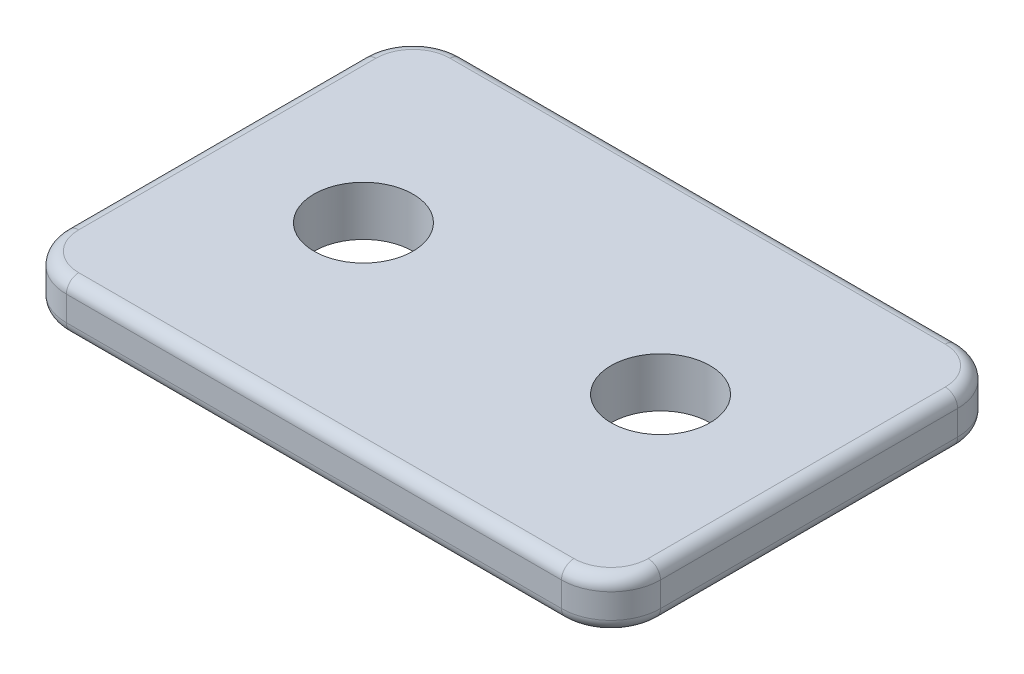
ISO-10303-21;
HEADER;
FILE_DESCRIPTION(('STEP AP214'),'2;1');
FILE_NAME('part.step','',(''),(''),'','','');
FILE_SCHEMA(('AUTOMOTIVE_DESIGN { 1 0 10303 214 1 1 1 1 }'));
ENDSEC;
DATA;
#1=APPLICATION_CONTEXT('core data for automotive mechanical design processes');
#2=APPLICATION_PROTOCOL_DEFINITION('international standard','automotive_design',2000,#1);
#3=PRODUCT_CONTEXT('',#1,'mechanical');
#4=PRODUCT('Part','Part','',(#3));
#5=PRODUCT_RELATED_PRODUCT_CATEGORY('part','',(#4));
#6=PRODUCT_DEFINITION_FORMATION('','',#4);
#7=PRODUCT_DEFINITION_CONTEXT('part definition',#1,'design');
#8=PRODUCT_DEFINITION('design','',#6,#7);
#9=PRODUCT_DEFINITION_SHAPE('','',#8);
#10=(LENGTH_UNIT() NAMED_UNIT(*) SI_UNIT(.MILLI.,.METRE.));
#11=(NAMED_UNIT(*) PLANE_ANGLE_UNIT() SI_UNIT($,.RADIAN.));
#12=(NAMED_UNIT(*) SI_UNIT($,.STERADIAN.) SOLID_ANGLE_UNIT());
#13=UNCERTAINTY_MEASURE_WITH_UNIT(LENGTH_MEASURE(1.E-05),#10,'distance_accuracy_value','');
#14=(GEOMETRIC_REPRESENTATION_CONTEXT(3) GLOBAL_UNCERTAINTY_ASSIGNED_CONTEXT((#13)) GLOBAL_UNIT_ASSIGNED_CONTEXT((#10,
#11,#12)) REPRESENTATION_CONTEXT('',''));
#15=CARTESIAN_POINT('',(0.,0.,0.));
#16=DIRECTION('',(0.,0.,1.));
#17=DIRECTION('',(1.,0.,0.));
#18=AXIS2_PLACEMENT_3D('',#15,#16,#17);
#19=CARTESIAN_POINT('',(0.,0.,50.8));
#20=DIRECTION('',(-1.,0.,0.));
#21=DIRECTION('',(0.,-1.,0.));
#22=AXIS2_PLACEMENT_3D('',#19,#20,#21);
#23=PLANE('',#22);
#24=DIRECTION('',(0.,1.,0.));
#25=VECTOR('',#24,1.);
#26=CARTESIAN_POINT('',(0.,6.34999999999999,44.45));
#27=LINE('',#26,#25);
#28=CARTESIAN_POINT('',(0.,1.5875,44.45));
#29=VERTEX_POINT('',#28);
#30=CARTESIAN_POINT('',(0.,4.76249999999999,44.45));
#31=VERTEX_POINT('',#30);
#32=EDGE_CURVE('E247',#29,#31,#27,.T.);
#33=ORIENTED_EDGE('',*,*,#32,.T.);
#34=DIRECTION('',(0.,0.,-1.));
#35=VECTOR('',#34,1.);
#36=CARTESIAN_POINT('',(0.,4.76249999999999,6.35));
#37=LINE('',#36,#35);
#38=CARTESIAN_POINT('',(0.,4.76249999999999,6.35));
#39=VERTEX_POINT('',#38);
#40=EDGE_CURVE('E11',#31,#39,#37,.T.);
#41=ORIENTED_EDGE('',*,*,#40,.T.);
#42=DIRECTION('',(0.,1.,0.));
#43=VECTOR('',#42,1.);
#44=CARTESIAN_POINT('',(0.,0.,6.35));
#45=LINE('',#44,#43);
#46=CARTESIAN_POINT('',(0.,1.5875,6.35));
#47=VERTEX_POINT('',#46);
#48=EDGE_CURVE('E248',#39,#47,#45,.F.);
#49=ORIENTED_EDGE('',*,*,#48,.T.);
#50=DIRECTION('',(0.,0.,-1.));
#51=VECTOR('',#50,1.);
#52=CARTESIAN_POINT('',(0.,1.5875,44.45));
#53=LINE('',#52,#51);
#54=EDGE_CURVE('E43',#47,#29,#53,.F.);
#55=ORIENTED_EDGE('',*,*,#54,.T.);
#56=EDGE_LOOP('',(#33,#41,#49,#55));
#57=FACE_BOUND('',#56,.T.);
#58=ADVANCED_FACE('F34',(#57),#23,.T.);
#59=CARTESIAN_POINT('',(0.,0.,50.8));
#60=DIRECTION('',(0.,1.,0.));
#61=DIRECTION('',(-1.,0.,0.));
#62=AXIS2_PLACEMENT_3D('',#59,#60,#61);
#63=PLANE('',#62);
#64=CARTESIAN_POINT('',(69.85,0.,6.35));
#65=DIRECTION('',(0.,1.,0.));
#66=DIRECTION('',(-1.,0.,0.));
#67=AXIS2_PLACEMENT_3D('',#64,#65,#66);
#68=CIRCLE('',#67,4.7625);
#69=CARTESIAN_POINT('',(69.85,0.,1.5875));
#70=VERTEX_POINT('',#69);
#71=CARTESIAN_POINT('',(74.6125,0.,6.35));
#72=VERTEX_POINT('',#71);
#73=EDGE_CURVE('E287',#70,#72,#68,.F.);
#74=ORIENTED_EDGE('',*,*,#73,.T.);
#75=DIRECTION('',(0.,0.,-1.));
#76=VECTOR('',#75,1.);
#77=CARTESIAN_POINT('',(74.6125,0.,44.45));
#78=LINE('',#77,#76);
#79=CARTESIAN_POINT('',(74.6125,0.,44.45));
#80=VERTEX_POINT('',#79);
#81=EDGE_CURVE('E282',#72,#80,#78,.F.);
#82=ORIENTED_EDGE('',*,*,#81,.T.);
#83=CARTESIAN_POINT('',(69.85,0.,44.45));
#84=DIRECTION('',(0.,1.,0.));
#85=DIRECTION('',(-1.,0.,0.));
#86=AXIS2_PLACEMENT_3D('',#83,#84,#85);
#87=CIRCLE('',#86,4.7625);
#88=CARTESIAN_POINT('',(69.85,0.,49.2125));
#89=VERTEX_POINT('',#88);
#90=EDGE_CURVE('E285',#80,#89,#87,.F.);
#91=ORIENTED_EDGE('',*,*,#90,.T.);
#92=DIRECTION('',(1.,0.,0.));
#93=VECTOR('',#92,1.);
#94=CARTESIAN_POINT('',(0.,0.,49.2125));
#95=LINE('',#94,#93);
#96=CARTESIAN_POINT('',(6.35,0.,49.2125));
#97=VERTEX_POINT('',#96);
#98=EDGE_CURVE('E289',#89,#97,#95,.F.);
#99=ORIENTED_EDGE('',*,*,#98,.T.);
#100=CARTESIAN_POINT('',(6.35,0.,44.45));
#101=DIRECTION('',(0.,1.,0.));
#102=DIRECTION('',(-1.,0.,0.));
#103=AXIS2_PLACEMENT_3D('',#100,#101,#102);
#104=CIRCLE('',#103,4.7625);
#105=CARTESIAN_POINT('',(1.5875,0.,44.45));
#106=VERTEX_POINT('',#105);
#107=EDGE_CURVE('E262',#97,#106,#104,.F.);
#108=ORIENTED_EDGE('',*,*,#107,.T.);
#109=DIRECTION('',(0.,0.,-1.));
#110=VECTOR('',#109,1.);
#111=CARTESIAN_POINT('',(1.5875,0.,6.35));
#112=LINE('',#111,#110);
#113=CARTESIAN_POINT('',(1.5875,0.,6.35));
#114=VERTEX_POINT('',#113);
#115=EDGE_CURVE('E258',#106,#114,#112,.T.);
#116=ORIENTED_EDGE('',*,*,#115,.T.);
#117=CARTESIAN_POINT('',(6.35,0.,6.35));
#118=DIRECTION('',(0.,1.,0.));
#119=DIRECTION('',(-1.,0.,0.));
#120=AXIS2_PLACEMENT_3D('',#117,#118,#119);
#121=CIRCLE('',#120,4.7625);
#122=CARTESIAN_POINT('',(6.35,0.,1.5875));
#123=VERTEX_POINT('',#122);
#124=EDGE_CURVE('E294',#114,#123,#121,.F.);
#125=ORIENTED_EDGE('',*,*,#124,.T.);
#126=DIRECTION('',(1.,0.,0.));
#127=VECTOR('',#126,1.);
#128=CARTESIAN_POINT('',(69.85,0.,1.5875));
#129=LINE('',#128,#127);
#130=EDGE_CURVE('E291',#123,#70,#129,.T.);
#131=ORIENTED_EDGE('',*,*,#130,.T.);
#132=EDGE_LOOP('',(#74,#82,#91,#99,#108,#116,#125,#131));
#133=FACE_BOUND('',#132,.T.);
#134=CARTESIAN_POINT('',(19.05,0.,25.4));
#135=DIRECTION('',(0.,1.,0.));
#136=DIRECTION('',(-1.,0.,0.));
#137=AXIS2_PLACEMENT_3D('',#134,#135,#136);
#138=CIRCLE('',#137,6.35);
#139=CARTESIAN_POINT('',(12.7,0.,25.4));
#140=VERTEX_POINT('',#139);
#141=EDGE_CURVE('E331',#140,#140,#138,.T.);
#142=ORIENTED_EDGE('',*,*,#141,.T.);
#143=EDGE_LOOP('',(#142));
#144=FACE_BOUND('',#143,.T.);
#145=CARTESIAN_POINT('',(57.15,0.,25.4));
#146=DIRECTION('',(0.,1.,0.));
#147=DIRECTION('',(-1.,0.,0.));
#148=AXIS2_PLACEMENT_3D('',#145,#146,#147);
#149=CIRCLE('',#148,6.35);
#150=CARTESIAN_POINT('',(50.8,0.,25.4));
#151=VERTEX_POINT('',#150);
#152=EDGE_CURVE('E327',#151,#151,#149,.T.);
#153=ORIENTED_EDGE('',*,*,#152,.T.);
#154=EDGE_LOOP('',(#153));
#155=FACE_BOUND('',#154,.T.);
#156=ADVANCED_FACE('F339',(#133,#144,#155),#63,.F.);
#157=CARTESIAN_POINT('',(76.2,6.34999999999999,50.8));
#158=DIRECTION('',(1.,0.,0.));
#159=DIRECTION('',(0.,1.,0.));
#160=AXIS2_PLACEMENT_3D('',#157,#158,#159);
#161=PLANE('',#160);
#162=DIRECTION('',(0.,-1.,0.));
#163=VECTOR('',#162,1.);
#164=CARTESIAN_POINT('',(76.2,6.34999999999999,6.35));
#165=LINE('',#164,#163);
#166=CARTESIAN_POINT('',(76.2,1.58749999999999,6.35));
#167=VERTEX_POINT('',#166);
#168=CARTESIAN_POINT('',(76.2,4.76249999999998,6.35));
#169=VERTEX_POINT('',#168);
#170=EDGE_CURVE('E170',#167,#169,#165,.F.);
#171=ORIENTED_EDGE('',*,*,#170,.T.);
#172=DIRECTION('',(0.,0.,-1.));
#173=VECTOR('',#172,1.);
#174=CARTESIAN_POINT('',(76.2,4.76249999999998,44.45));
#175=LINE('',#174,#173);
#176=CARTESIAN_POINT('',(76.2,4.76249999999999,44.45));
#177=VERTEX_POINT('',#176);
#178=EDGE_CURVE('E297',#169,#177,#175,.F.);
#179=ORIENTED_EDGE('',*,*,#178,.T.);
#180=DIRECTION('',(0.,-1.,0.));
#181=VECTOR('',#180,1.);
#182=CARTESIAN_POINT('',(76.2,0.,44.45));
#183=LINE('',#182,#181);
#184=CARTESIAN_POINT('',(76.2,1.58749999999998,44.45));
#185=VERTEX_POINT('',#184);
#186=EDGE_CURVE('E316',#177,#185,#183,.T.);
#187=ORIENTED_EDGE('',*,*,#186,.T.);
#188=DIRECTION('',(0.,0.,-1.));
#189=VECTOR('',#188,1.);
#190=CARTESIAN_POINT('',(76.2,1.58749999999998,6.35));
#191=LINE('',#190,#189);
#192=EDGE_CURVE('E300',#185,#167,#191,.T.);
#193=ORIENTED_EDGE('',*,*,#192,.T.);
#194=EDGE_LOOP('',(#171,#179,#187,#193));
#195=FACE_BOUND('',#194,.T.);
#196=ADVANCED_FACE('F351',(#195),#161,.T.);
#197=CARTESIAN_POINT('',(76.2,6.34999999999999,50.8));
#198=DIRECTION('',(0.,-1.,0.));
#199=DIRECTION('',(0.,0.,-1.));
#200=AXIS2_PLACEMENT_3D('',#197,#198,#199);
#201=PLANE('',#200);
#202=CARTESIAN_POINT('',(69.85,6.34999999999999,44.45));
#203=DIRECTION('',(0.,-1.,0.));
#204=DIRECTION('',(0.,0.,-1.));
#205=AXIS2_PLACEMENT_3D('',#202,#203,#204);
#206=CIRCLE('',#205,4.7625);
#207=CARTESIAN_POINT('',(69.85,6.34999999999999,49.2125));
#208=VERTEX_POINT('',#207);
#209=CARTESIAN_POINT('',(74.6125,6.34999999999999,44.45));
#210=VERTEX_POINT('',#209);
#211=EDGE_CURVE('E306',#208,#210,#206,.F.);
#212=ORIENTED_EDGE('',*,*,#211,.T.);
#213=DIRECTION('',(0.,0.,-1.));
#214=VECTOR('',#213,1.);
#215=CARTESIAN_POINT('',(74.6125,6.34999999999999,6.35));
#216=LINE('',#215,#214);
#217=CARTESIAN_POINT('',(74.6125,6.34999999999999,6.35));
#218=VERTEX_POINT('',#217);
#219=EDGE_CURVE('E303',#210,#218,#216,.T.);
#220=ORIENTED_EDGE('',*,*,#219,.T.);
#221=CARTESIAN_POINT('',(69.85,6.34999999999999,6.35));
#222=DIRECTION('',(0.,-1.,0.));
#223=DIRECTION('',(0.,0.,-1.));
#224=AXIS2_PLACEMENT_3D('',#221,#222,#223);
#225=CIRCLE('',#224,4.7625);
#226=CARTESIAN_POINT('',(69.85,6.34999999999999,1.5875));
#227=VERTEX_POINT('',#226);
#228=EDGE_CURVE('E308',#218,#227,#225,.F.);
#229=ORIENTED_EDGE('',*,*,#228,.T.);
#230=DIRECTION('',(-1.,0.,0.));
#231=VECTOR('',#230,1.);
#232=CARTESIAN_POINT('',(6.35000000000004,6.34999999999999,1.5875));
#233=LINE('',#232,#231);
#234=CARTESIAN_POINT('',(6.35000000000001,6.34999999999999,1.5875));
#235=VERTEX_POINT('',#234);
#236=EDGE_CURVE('E155',#227,#235,#233,.T.);
#237=ORIENTED_EDGE('',*,*,#236,.T.);
#238=CARTESIAN_POINT('',(6.35000000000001,6.34999999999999,6.35));
#239=DIRECTION('',(0.,-1.,0.));
#240=DIRECTION('',(0.,0.,-1.));
#241=AXIS2_PLACEMENT_3D('',#238,#239,#240);
#242=CIRCLE('',#241,4.7625);
#243=CARTESIAN_POINT('',(1.58750000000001,6.34999999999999,6.35));
#244=VERTEX_POINT('',#243);
#245=EDGE_CURVE('E148',#235,#244,#242,.F.);
#246=ORIENTED_EDGE('',*,*,#245,.T.);
#247=DIRECTION('',(0.,0.,-1.));
#248=VECTOR('',#247,1.);
#249=CARTESIAN_POINT('',(1.58750000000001,6.34999999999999,44.45));
#250=LINE('',#249,#248);
#251=CARTESIAN_POINT('',(1.58750000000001,6.34999999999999,44.45));
#252=VERTEX_POINT('',#251);
#253=EDGE_CURVE('E152',#244,#252,#250,.F.);
#254=ORIENTED_EDGE('',*,*,#253,.T.);
#255=CARTESIAN_POINT('',(6.35000000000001,6.34999999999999,44.45));
#256=DIRECTION('',(0.,-1.,0.));
#257=DIRECTION('',(0.,0.,-1.));
#258=AXIS2_PLACEMENT_3D('',#255,#256,#257);
#259=CIRCLE('',#258,4.7625);
#260=CARTESIAN_POINT('',(6.35000000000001,6.34999999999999,49.2125));
#261=VERTEX_POINT('',#260);
#262=EDGE_CURVE('E160',#252,#261,#259,.F.);
#263=ORIENTED_EDGE('',*,*,#262,.T.);
#264=DIRECTION('',(-1.,0.,0.));
#265=VECTOR('',#264,1.);
#266=CARTESIAN_POINT('',(76.2,6.34999999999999,49.2125));
#267=LINE('',#266,#265);
#268=EDGE_CURVE('E310',#261,#208,#267,.F.);
#269=ORIENTED_EDGE('',*,*,#268,.T.);
#270=EDGE_LOOP('',(#212,#220,#229,#237,#246,#254,#263,#269));
#271=FACE_BOUND('',#270,.T.);
#272=CARTESIAN_POINT('',(19.05,6.34999999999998,25.4));
#273=DIRECTION('',(0.,1.,0.));
#274=DIRECTION('',(-1.,0.,0.));
#275=AXIS2_PLACEMENT_3D('',#272,#273,#274);
#276=CIRCLE('',#275,6.35);
#277=CARTESIAN_POINT('',(12.7,6.34999999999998,25.4));
#278=VERTEX_POINT('',#277);
#279=EDGE_CURVE('E176',#278,#278,#276,.T.);
#280=ORIENTED_EDGE('',*,*,#279,.F.);
#281=EDGE_LOOP('',(#280));
#282=FACE_BOUND('',#281,.T.);
#283=CARTESIAN_POINT('',(57.15,6.34999999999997,25.4));
#284=DIRECTION('',(0.,1.,0.));
#285=DIRECTION('',(-1.,0.,0.));
#286=AXIS2_PLACEMENT_3D('',#283,#284,#285);
#287=CIRCLE('',#286,6.35);
#288=CARTESIAN_POINT('',(50.8,6.34999999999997,25.4));
#289=VERTEX_POINT('',#288);
#290=EDGE_CURVE('E328',#289,#289,#287,.T.);
#291=ORIENTED_EDGE('',*,*,#290,.F.);
#292=EDGE_LOOP('',(#291));
#293=FACE_BOUND('',#292,.T.);
#294=ADVANCED_FACE('F150',(#271,#282,#293),#201,.F.);
#295=CARTESIAN_POINT('',(0.,0.,50.8));
#296=DIRECTION('',(0.,0.,-1.));
#297=DIRECTION('',(-1.,0.,0.));
#298=AXIS2_PLACEMENT_3D('',#295,#296,#297);
#299=PLANE('',#298);
#300=DIRECTION('',(0.,-1.,0.));
#301=VECTOR('',#300,1.);
#302=CARTESIAN_POINT('',(69.85,6.35,50.8));
#303=LINE('',#302,#301);
#304=CARTESIAN_POINT('',(69.85,1.58749999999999,50.8));
#305=VERTEX_POINT('',#304);
#306=CARTESIAN_POINT('',(69.85,4.76249999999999,50.8));
#307=VERTEX_POINT('',#306);
#308=EDGE_CURVE('E255',#305,#307,#303,.F.);
#309=ORIENTED_EDGE('',*,*,#308,.T.);
#310=DIRECTION('',(-1.,0.,0.));
#311=VECTOR('',#310,1.);
#312=CARTESIAN_POINT('',(0.,4.76249999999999,50.8));
#313=LINE('',#312,#311);
#314=CARTESIAN_POINT('',(6.35000000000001,4.76249999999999,50.8));
#315=VERTEX_POINT('',#314);
#316=EDGE_CURVE('E239',#307,#315,#313,.T.);
#317=ORIENTED_EDGE('',*,*,#316,.T.);
#318=DIRECTION('',(0.,1.,0.));
#319=VECTOR('',#318,1.);
#320=CARTESIAN_POINT('',(6.35,0.,50.8));
#321=LINE('',#320,#319);
#322=CARTESIAN_POINT('',(6.35,1.5875,50.8));
#323=VERTEX_POINT('',#322);
#324=EDGE_CURVE('E323',#315,#323,#321,.F.);
#325=ORIENTED_EDGE('',*,*,#324,.T.);
#326=DIRECTION('',(1.,0.,0.));
#327=VECTOR('',#326,1.);
#328=CARTESIAN_POINT('',(0.,1.5875,50.8));
#329=LINE('',#328,#327);
#330=EDGE_CURVE('E266',#323,#305,#329,.T.);
#331=ORIENTED_EDGE('',*,*,#330,.T.);
#332=EDGE_LOOP('',(#309,#317,#325,#331));
#333=FACE_BOUND('',#332,.T.);
#334=ADVANCED_FACE('F350',(#333),#299,.F.);
#335=CARTESIAN_POINT('',(0.,0.,0.));
#336=DIRECTION('',(0.,0.,-1.));
#337=DIRECTION('',(-1.,0.,0.));
#338=AXIS2_PLACEMENT_3D('',#335,#336,#337);
#339=PLANE('',#338);
#340=DIRECTION('',(0.,1.,0.));
#341=VECTOR('',#340,1.);
#342=CARTESIAN_POINT('',(6.35,0.,0.));
#343=LINE('',#342,#341);
#344=CARTESIAN_POINT('',(6.35,1.5875,0.));
#345=VERTEX_POINT('',#344);
#346=CARTESIAN_POINT('',(6.35000000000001,4.76249999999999,0.));
#347=VERTEX_POINT('',#346);
#348=EDGE_CURVE('E319',#345,#347,#343,.T.);
#349=ORIENTED_EDGE('',*,*,#348,.T.);
#350=DIRECTION('',(-1.,0.,0.));
#351=VECTOR('',#350,1.);
#352=CARTESIAN_POINT('',(69.85,4.76249999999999,0.));
#353=LINE('',#352,#351);
#354=CARTESIAN_POINT('',(69.85,4.76249999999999,0.));
#355=VERTEX_POINT('',#354);
#356=EDGE_CURVE('E228',#347,#355,#353,.F.);
#357=ORIENTED_EDGE('',*,*,#356,.T.);
#358=DIRECTION('',(0.,-1.,0.));
#359=VECTOR('',#358,1.);
#360=CARTESIAN_POINT('',(69.85,-1.52655665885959E-13,0.));
#361=LINE('',#360,#359);
#362=CARTESIAN_POINT('',(69.85,1.58749999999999,0.));
#363=VERTEX_POINT('',#362);
#364=EDGE_CURVE('E321',#355,#363,#361,.T.);
#365=ORIENTED_EDGE('',*,*,#364,.T.);
#366=DIRECTION('',(1.,0.,0.));
#367=VECTOR('',#366,1.);
#368=CARTESIAN_POINT('',(6.35,1.5875,0.));
#369=LINE('',#368,#367);
#370=EDGE_CURVE('E235',#363,#345,#369,.F.);
#371=ORIENTED_EDGE('',*,*,#370,.T.);
#372=EDGE_LOOP('',(#349,#357,#365,#371));
#373=FACE_BOUND('',#372,.T.);
#374=ADVANCED_FACE('F356',(#373),#339,.T.);
#375=CARTESIAN_POINT('',(57.15,0.,25.4));
#376=DIRECTION('',(0.,1.,0.));
#377=DIRECTION('',(-1.,0.,0.));
#378=AXIS2_PLACEMENT_3D('',#375,#376,#377);
#379=CYLINDRICAL_SURFACE('',#378,6.35);
#380=ORIENTED_EDGE('',*,*,#152,.F.);
#381=EDGE_LOOP('',(#380));
#382=FACE_BOUND('',#381,.T.);
#383=ORIENTED_EDGE('',*,*,#290,.T.);
#384=EDGE_LOOP('',(#383));
#385=FACE_BOUND('',#384,.T.);
#386=ADVANCED_FACE('F345',(#382,#385),#379,.F.);
#387=CARTESIAN_POINT('',(19.05,0.,25.4));
#388=DIRECTION('',(0.,1.,0.));
#389=DIRECTION('',(-1.,0.,0.));
#390=AXIS2_PLACEMENT_3D('',#387,#388,#389);
#391=CYLINDRICAL_SURFACE('',#390,6.35);
#392=ORIENTED_EDGE('',*,*,#141,.F.);
#393=EDGE_LOOP('',(#392));
#394=FACE_BOUND('',#393,.T.);
#395=ORIENTED_EDGE('',*,*,#279,.T.);
#396=EDGE_LOOP('',(#395));
#397=FACE_BOUND('',#396,.T.);
#398=ADVANCED_FACE('F342',(#394,#397),#391,.F.);
#399=CARTESIAN_POINT('',(6.35,0.,44.45));
#400=DIRECTION('',(0.,-1.,0.));
#401=DIRECTION('',(1.,0.,0.));
#402=AXIS2_PLACEMENT_3D('',#399,#400,#401);
#403=CYLINDRICAL_SURFACE('',#402,6.35);
#404=ORIENTED_EDGE('',*,*,#324,.F.);
#405=CARTESIAN_POINT('',(6.35000000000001,4.76249999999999,44.45));
#406=DIRECTION('',(0.,-1.,0.));
#407=DIRECTION('',(0.,0.,-1.));
#408=AXIS2_PLACEMENT_3D('',#405,#406,#407);
#409=CIRCLE('',#408,6.35);
#410=EDGE_CURVE('E237',#315,#31,#409,.T.);
#411=ORIENTED_EDGE('',*,*,#410,.T.);
#412=ORIENTED_EDGE('',*,*,#32,.F.);
#413=CARTESIAN_POINT('',(6.35,1.5875,44.45));
#414=DIRECTION('',(0.,1.,0.));
#415=DIRECTION('',(-1.,0.,0.));
#416=AXIS2_PLACEMENT_3D('',#413,#414,#415);
#417=CIRCLE('',#416,6.35);
#418=EDGE_CURVE('E234',#29,#323,#417,.T.);
#419=ORIENTED_EDGE('',*,*,#418,.T.);
#420=EDGE_LOOP('',(#404,#411,#412,#419));
#421=FACE_BOUND('',#420,.T.);
#422=ADVANCED_FACE('F252',(#421),#403,.T.);
#423=CARTESIAN_POINT('',(6.35,0.,6.35));
#424=DIRECTION('',(0.,1.,0.));
#425=DIRECTION('',(-1.,0.,0.));
#426=AXIS2_PLACEMENT_3D('',#423,#424,#425);
#427=CYLINDRICAL_SURFACE('',#426,6.35);
#428=ORIENTED_EDGE('',*,*,#48,.F.);
#429=CARTESIAN_POINT('',(6.35000000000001,4.76249999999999,6.35));
#430=DIRECTION('',(0.,-1.,0.));
#431=DIRECTION('',(0.,0.,-1.));
#432=AXIS2_PLACEMENT_3D('',#429,#430,#431);
#433=CIRCLE('',#432,6.35);
#434=EDGE_CURVE('E173',#39,#347,#433,.T.);
#435=ORIENTED_EDGE('',*,*,#434,.T.);
#436=ORIENTED_EDGE('',*,*,#348,.F.);
#437=CARTESIAN_POINT('',(6.35,1.5875,6.35));
#438=DIRECTION('',(0.,1.,0.));
#439=DIRECTION('',(-1.,0.,0.));
#440=AXIS2_PLACEMENT_3D('',#437,#438,#439);
#441=CIRCLE('',#440,6.35);
#442=EDGE_CURVE('E51',#345,#47,#441,.T.);
#443=ORIENTED_EDGE('',*,*,#442,.T.);
#444=EDGE_LOOP('',(#428,#435,#436,#443));
#445=FACE_BOUND('',#444,.T.);
#446=ADVANCED_FACE('F376',(#445),#427,.T.);
#447=CARTESIAN_POINT('',(69.85,-1.52655665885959E-13,6.35));
#448=DIRECTION('',(0.,-1.,0.));
#449=DIRECTION('',(1.,0.,0.));
#450=AXIS2_PLACEMENT_3D('',#447,#448,#449);
#451=CYLINDRICAL_SURFACE('',#450,6.35);
#452=ORIENTED_EDGE('',*,*,#364,.F.);
#453=CARTESIAN_POINT('',(69.85,4.76249999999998,6.35));
#454=DIRECTION('',(0.,-1.,0.));
#455=DIRECTION('',(0.,0.,-1.));
#456=AXIS2_PLACEMENT_3D('',#453,#454,#455);
#457=CIRCLE('',#456,6.35);
#458=EDGE_CURVE('E272',#355,#169,#457,.T.);
#459=ORIENTED_EDGE('',*,*,#458,.T.);
#460=ORIENTED_EDGE('',*,*,#170,.F.);
#461=CARTESIAN_POINT('',(69.85,1.58749999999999,6.35));
#462=DIRECTION('',(0.,1.,0.));
#463=DIRECTION('',(-1.,0.,0.));
#464=AXIS2_PLACEMENT_3D('',#461,#462,#463);
#465=CIRCLE('',#464,6.35);
#466=EDGE_CURVE('E274',#167,#363,#465,.T.);
#467=ORIENTED_EDGE('',*,*,#466,.T.);
#468=EDGE_LOOP('',(#452,#459,#460,#467));
#469=FACE_BOUND('',#468,.T.);
#470=ADVANCED_FACE('F379',(#469),#451,.T.);
#471=CARTESIAN_POINT('',(69.85,6.35,44.45));
#472=DIRECTION('',(0.,1.,0.));
#473=DIRECTION('',(-1.,0.,0.));
#474=AXIS2_PLACEMENT_3D('',#471,#472,#473);
#475=CYLINDRICAL_SURFACE('',#474,6.35);
#476=ORIENTED_EDGE('',*,*,#186,.F.);
#477=CARTESIAN_POINT('',(69.85,4.76249999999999,44.45));
#478=DIRECTION('',(0.,-1.,0.));
#479=DIRECTION('',(0.,0.,-1.));
#480=AXIS2_PLACEMENT_3D('',#477,#478,#479);
#481=CIRCLE('',#480,6.35);
#482=EDGE_CURVE('E278',#177,#307,#481,.T.);
#483=ORIENTED_EDGE('',*,*,#482,.T.);
#484=ORIENTED_EDGE('',*,*,#308,.F.);
#485=CARTESIAN_POINT('',(69.85,1.58749999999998,44.45));
#486=DIRECTION('',(0.,1.,0.));
#487=DIRECTION('',(-1.,0.,0.));
#488=AXIS2_PLACEMENT_3D('',#485,#486,#487);
#489=CIRCLE('',#488,6.35);
#490=EDGE_CURVE('E280',#305,#185,#489,.T.);
#491=ORIENTED_EDGE('',*,*,#490,.T.);
#492=EDGE_LOOP('',(#476,#483,#484,#491));
#493=FACE_BOUND('',#492,.T.);
#494=ADVANCED_FACE('F382',(#493),#475,.T.);
#495=CARTESIAN_POINT('',(1.58750000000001,4.76249999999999,50.8));
#496=DIRECTION('',(0.,0.,1.));
#497=DIRECTION('',(1.,0.,0.));
#498=AXIS2_PLACEMENT_3D('',#495,#496,#497);
#499=CYLINDRICAL_SURFACE('',#498,1.5875);
#500=CARTESIAN_POINT('',(1.58750000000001,4.76249999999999,6.35));
#501=DIRECTION('',(0.,0.,-1.));
#502=DIRECTION('',(-1.,0.,0.));
#503=AXIS2_PLACEMENT_3D('',#500,#501,#502);
#504=CIRCLE('',#503,1.5875);
#505=EDGE_CURVE('E165',#39,#244,#504,.T.);
#506=ORIENTED_EDGE('',*,*,#505,.F.);
#507=ORIENTED_EDGE('',*,*,#40,.F.);
#508=CARTESIAN_POINT('',(1.58750000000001,4.76249999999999,44.45));
#509=DIRECTION('',(0.,0.,1.));
#510=DIRECTION('',(1.,0.,0.));
#511=AXIS2_PLACEMENT_3D('',#508,#509,#510);
#512=CIRCLE('',#511,1.5875);
#513=EDGE_CURVE('E168',#252,#31,#512,.T.);
#514=ORIENTED_EDGE('',*,*,#513,.F.);
#515=ORIENTED_EDGE('',*,*,#253,.F.);
#516=EDGE_LOOP('',(#506,#507,#514,#515));
#517=FACE_BOUND('',#516,.T.);
#518=ADVANCED_FACE('F164',(#517),#499,.T.);
#519=CARTESIAN_POINT('',(6.35000000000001,4.76249999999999,44.45));
#520=DIRECTION('',(0.,-1.,0.));
#521=DIRECTION('',(0.,0.,-1.));
#522=AXIS2_PLACEMENT_3D('',#519,#520,#521);
#523=TOROIDAL_SURFACE('',#522,4.7625,1.5875);
#524=ORIENTED_EDGE('',*,*,#513,.T.);
#525=ORIENTED_EDGE('',*,*,#410,.F.);
#526=CARTESIAN_POINT('',(6.35000000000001,4.76249999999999,49.2125));
#527=DIRECTION('',(1.,0.,0.));
#528=DIRECTION('',(0.,0.,-1.));
#529=AXIS2_PLACEMENT_3D('',#526,#527,#528);
#530=CIRCLE('',#529,1.5875);
#531=EDGE_CURVE('E174',#261,#315,#530,.T.);
#532=ORIENTED_EDGE('',*,*,#531,.F.);
#533=ORIENTED_EDGE('',*,*,#262,.F.);
#534=EDGE_LOOP('',(#524,#525,#532,#533));
#535=FACE_BOUND('',#534,.T.);
#536=ADVANCED_FACE('F406',(#535),#523,.T.);
#537=CARTESIAN_POINT('',(6.35000000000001,4.76249999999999,6.35));
#538=DIRECTION('',(0.,-1.,0.));
#539=DIRECTION('',(0.,0.,-1.));
#540=AXIS2_PLACEMENT_3D('',#537,#538,#539);
#541=TOROIDAL_SURFACE('',#540,4.7625,1.5875);
#542=ORIENTED_EDGE('',*,*,#505,.T.);
#543=ORIENTED_EDGE('',*,*,#245,.F.);
#544=CARTESIAN_POINT('',(6.35000000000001,4.76249999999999,1.5875));
#545=DIRECTION('',(1.,0.,0.));
#546=DIRECTION('',(0.,0.,-1.));
#547=AXIS2_PLACEMENT_3D('',#544,#545,#546);
#548=CIRCLE('',#547,1.5875);
#549=EDGE_CURVE('E179',#347,#235,#548,.T.);
#550=ORIENTED_EDGE('',*,*,#549,.F.);
#551=ORIENTED_EDGE('',*,*,#434,.F.);
#552=EDGE_LOOP('',(#542,#543,#550,#551));
#553=FACE_BOUND('',#552,.T.);
#554=ADVANCED_FACE('F172',(#553),#541,.T.);
#555=CARTESIAN_POINT('',(0.,4.76249999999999,49.2125));
#556=DIRECTION('',(-1.,0.,0.));
#557=DIRECTION('',(0.,0.,1.));
#558=AXIS2_PLACEMENT_3D('',#555,#556,#557);
#559=CYLINDRICAL_SURFACE('',#558,1.5875);
#560=ORIENTED_EDGE('',*,*,#531,.T.);
#561=ORIENTED_EDGE('',*,*,#316,.F.);
#562=CARTESIAN_POINT('',(69.85,4.76249999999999,49.2125));
#563=DIRECTION('',(1.,0.,0.));
#564=DIRECTION('',(0.,0.,-1.));
#565=AXIS2_PLACEMENT_3D('',#562,#563,#564);
#566=CIRCLE('',#565,1.5875);
#567=EDGE_CURVE('E222',#208,#307,#566,.T.);
#568=ORIENTED_EDGE('',*,*,#567,.F.);
#569=ORIENTED_EDGE('',*,*,#268,.F.);
#570=EDGE_LOOP('',(#560,#561,#568,#569));
#571=FACE_BOUND('',#570,.T.);
#572=ADVANCED_FACE('F400',(#571),#559,.T.);
#573=CARTESIAN_POINT('',(76.2,4.76249999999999,1.5875));
#574=DIRECTION('',(1.,0.,0.));
#575=DIRECTION('',(0.,0.,-1.));
#576=AXIS2_PLACEMENT_3D('',#573,#574,#575);
#577=CYLINDRICAL_SURFACE('',#576,1.5875);
#578=ORIENTED_EDGE('',*,*,#549,.T.);
#579=ORIENTED_EDGE('',*,*,#236,.F.);
#580=CARTESIAN_POINT('',(69.85,4.76249999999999,1.5875));
#581=DIRECTION('',(1.,0.,0.));
#582=DIRECTION('',(0.,0.,-1.));
#583=AXIS2_PLACEMENT_3D('',#580,#581,#582);
#584=CIRCLE('',#583,1.5875);
#585=EDGE_CURVE('E216',#355,#227,#584,.T.);
#586=ORIENTED_EDGE('',*,*,#585,.F.);
#587=ORIENTED_EDGE('',*,*,#356,.F.);
#588=EDGE_LOOP('',(#578,#579,#586,#587));
#589=FACE_BOUND('',#588,.T.);
#590=ADVANCED_FACE('F226',(#589),#577,.T.);
#591=CARTESIAN_POINT('',(69.85,4.76249999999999,44.45));
#592=DIRECTION('',(0.,-1.,0.));
#593=DIRECTION('',(0.,0.,-1.));
#594=AXIS2_PLACEMENT_3D('',#591,#592,#593);
#595=TOROIDAL_SURFACE('',#594,4.7625,1.5875);
#596=ORIENTED_EDGE('',*,*,#567,.T.);
#597=ORIENTED_EDGE('',*,*,#482,.F.);
#598=CARTESIAN_POINT('',(74.6125,4.76249999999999,44.45));
#599=DIRECTION('',(0.,0.,-1.));
#600=DIRECTION('',(-1.,0.,0.));
#601=AXIS2_PLACEMENT_3D('',#598,#599,#600);
#602=CIRCLE('',#601,1.5875);
#603=EDGE_CURVE('E209',#210,#177,#602,.T.);
#604=ORIENTED_EDGE('',*,*,#603,.F.);
#605=ORIENTED_EDGE('',*,*,#211,.F.);
#606=EDGE_LOOP('',(#596,#597,#604,#605));
#607=FACE_BOUND('',#606,.T.);
#608=ADVANCED_FACE('F393',(#607),#595,.T.);
#609=CARTESIAN_POINT('',(69.85,4.76249999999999,6.35));
#610=DIRECTION('',(0.,-1.,0.));
#611=DIRECTION('',(0.,0.,-1.));
#612=AXIS2_PLACEMENT_3D('',#609,#610,#611);
#613=TOROIDAL_SURFACE('',#612,4.7625,1.5875);
#614=ORIENTED_EDGE('',*,*,#585,.T.);
#615=ORIENTED_EDGE('',*,*,#228,.F.);
#616=CARTESIAN_POINT('',(74.6125,4.76249999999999,6.35));
#617=DIRECTION('',(0.,0.,1.));
#618=DIRECTION('',(1.,0.,0.));
#619=AXIS2_PLACEMENT_3D('',#616,#617,#618);
#620=CIRCLE('',#619,1.5875);
#621=EDGE_CURVE('E204',#169,#218,#620,.T.);
#622=ORIENTED_EDGE('',*,*,#621,.F.);
#623=ORIENTED_EDGE('',*,*,#458,.F.);
#624=EDGE_LOOP('',(#614,#615,#622,#623));
#625=FACE_BOUND('',#624,.T.);
#626=ADVANCED_FACE('F390',(#625),#613,.T.);
#627=CARTESIAN_POINT('',(74.6125,4.76249999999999,50.8));
#628=DIRECTION('',(0.,0.,1.));
#629=DIRECTION('',(1.,0.,0.));
#630=AXIS2_PLACEMENT_3D('',#627,#628,#629);
#631=CYLINDRICAL_SURFACE('',#630,1.5875);
#632=ORIENTED_EDGE('',*,*,#603,.T.);
#633=ORIENTED_EDGE('',*,*,#178,.F.);
#634=ORIENTED_EDGE('',*,*,#621,.T.);
#635=ORIENTED_EDGE('',*,*,#219,.F.);
#636=EDGE_LOOP('',(#632,#633,#634,#635));
#637=FACE_BOUND('',#636,.T.);
#638=ADVANCED_FACE('F387',(#637),#631,.T.);
#639=CARTESIAN_POINT('',(1.5875,1.5875,50.8));
#640=DIRECTION('',(0.,0.,1.));
#641=DIRECTION('',(1.,0.,0.));
#642=AXIS2_PLACEMENT_3D('',#639,#640,#641);
#643=CYLINDRICAL_SURFACE('',#642,1.5875);
#644=CARTESIAN_POINT('',(1.5875,1.5875,6.35));
#645=DIRECTION('',(0.,0.,-1.));
#646=DIRECTION('',(-1.,0.,0.));
#647=AXIS2_PLACEMENT_3D('',#644,#645,#646);
#648=CIRCLE('',#647,1.5875);
#649=EDGE_CURVE('E198',#114,#47,#648,.T.);
#650=ORIENTED_EDGE('',*,*,#649,.F.);
#651=ORIENTED_EDGE('',*,*,#115,.F.);
#652=CARTESIAN_POINT('',(1.5875,1.5875,44.45));
#653=DIRECTION('',(0.,0.,1.));
#654=DIRECTION('',(1.,0.,0.));
#655=AXIS2_PLACEMENT_3D('',#652,#653,#654);
#656=CIRCLE('',#655,1.5875);
#657=EDGE_CURVE('E38',#29,#106,#656,.T.);
#658=ORIENTED_EDGE('',*,*,#657,.F.);
#659=ORIENTED_EDGE('',*,*,#54,.F.);
#660=EDGE_LOOP('',(#650,#651,#658,#659));
#661=FACE_BOUND('',#660,.T.);
#662=ADVANCED_FACE('F36',(#661),#643,.T.);
#663=CARTESIAN_POINT('',(6.35,1.5875,44.45));
#664=DIRECTION('',(0.,1.,0.));
#665=DIRECTION('',(-1.,0.,0.));
#666=AXIS2_PLACEMENT_3D('',#663,#664,#665);
#667=TOROIDAL_SURFACE('',#666,4.7625,1.5875);
#668=ORIENTED_EDGE('',*,*,#657,.T.);
#669=ORIENTED_EDGE('',*,*,#107,.F.);
#670=CARTESIAN_POINT('',(6.35,1.5875,49.2125));
#671=DIRECTION('',(1.,0.,0.));
#672=DIRECTION('',(0.,0.,-1.));
#673=AXIS2_PLACEMENT_3D('',#670,#671,#672);
#674=CIRCLE('',#673,1.5875);
#675=EDGE_CURVE('E196',#323,#97,#674,.T.);
#676=ORIENTED_EDGE('',*,*,#675,.F.);
#677=ORIENTED_EDGE('',*,*,#418,.F.);
#678=EDGE_LOOP('',(#668,#669,#676,#677));
#679=FACE_BOUND('',#678,.T.);
#680=ADVANCED_FACE('F260',(#679),#667,.T.);
#681=CARTESIAN_POINT('',(6.35,1.5875,6.35));
#682=DIRECTION('',(0.,1.,0.));
#683=DIRECTION('',(-1.,0.,0.));
#684=AXIS2_PLACEMENT_3D('',#681,#682,#683);
#685=TOROIDAL_SURFACE('',#684,4.7625,1.5875);
#686=ORIENTED_EDGE('',*,*,#649,.T.);
#687=ORIENTED_EDGE('',*,*,#442,.F.);
#688=CARTESIAN_POINT('',(6.35,1.5875,1.5875));
#689=DIRECTION('',(1.,0.,0.));
#690=DIRECTION('',(0.,0.,-1.));
#691=AXIS2_PLACEMENT_3D('',#688,#689,#690);
#692=CIRCLE('',#691,1.5875);
#693=EDGE_CURVE('E193',#123,#345,#692,.T.);
#694=ORIENTED_EDGE('',*,*,#693,.F.);
#695=ORIENTED_EDGE('',*,*,#124,.F.);
#696=EDGE_LOOP('',(#686,#687,#694,#695));
#697=FACE_BOUND('',#696,.T.);
#698=ADVANCED_FACE('F430',(#697),#685,.T.);
#699=CARTESIAN_POINT('',(0.,1.5875,49.2125));
#700=DIRECTION('',(1.,0.,0.));
#701=DIRECTION('',(0.,1.,0.));
#702=AXIS2_PLACEMENT_3D('',#699,#700,#701);
#703=CYLINDRICAL_SURFACE('',#702,1.5875);
#704=ORIENTED_EDGE('',*,*,#675,.T.);
#705=ORIENTED_EDGE('',*,*,#98,.F.);
#706=CARTESIAN_POINT('',(69.85,1.58749999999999,49.2125));
#707=DIRECTION('',(1.,0.,0.));
#708=DIRECTION('',(0.,0.,-1.));
#709=AXIS2_PLACEMENT_3D('',#706,#707,#708);
#710=CIRCLE('',#709,1.5875);
#711=EDGE_CURVE('E190',#305,#89,#710,.T.);
#712=ORIENTED_EDGE('',*,*,#711,.F.);
#713=ORIENTED_EDGE('',*,*,#330,.F.);
#714=EDGE_LOOP('',(#704,#705,#712,#713));
#715=FACE_BOUND('',#714,.T.);
#716=ADVANCED_FACE('F267',(#715),#703,.T.);
#717=CARTESIAN_POINT('',(0.,1.5875,1.5875));
#718=DIRECTION('',(-1.,0.,0.));
#719=DIRECTION('',(0.,-1.,0.));
#720=AXIS2_PLACEMENT_3D('',#717,#718,#719);
#721=CYLINDRICAL_SURFACE('',#720,1.5875);
#722=ORIENTED_EDGE('',*,*,#693,.T.);
#723=ORIENTED_EDGE('',*,*,#370,.F.);
#724=CARTESIAN_POINT('',(69.85,1.58749999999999,1.5875));
#725=DIRECTION('',(1.,0.,0.));
#726=DIRECTION('',(0.,0.,-1.));
#727=AXIS2_PLACEMENT_3D('',#724,#725,#726);
#728=CIRCLE('',#727,1.5875);
#729=EDGE_CURVE('E187',#70,#363,#728,.T.);
#730=ORIENTED_EDGE('',*,*,#729,.F.);
#731=ORIENTED_EDGE('',*,*,#130,.F.);
#732=EDGE_LOOP('',(#722,#723,#730,#731));
#733=FACE_BOUND('',#732,.T.);
#734=ADVANCED_FACE('F423',(#733),#721,.T.);
#735=CARTESIAN_POINT('',(69.85,1.58749999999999,44.45));
#736=DIRECTION('',(0.,1.,0.));
#737=DIRECTION('',(-1.,0.,0.));
#738=AXIS2_PLACEMENT_3D('',#735,#736,#737);
#739=TOROIDAL_SURFACE('',#738,4.7625,1.5875);
#740=ORIENTED_EDGE('',*,*,#711,.T.);
#741=ORIENTED_EDGE('',*,*,#90,.F.);
#742=CARTESIAN_POINT('',(74.6125,1.58749999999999,44.45));
#743=DIRECTION('',(0.,0.,-1.));
#744=DIRECTION('',(-1.,0.,0.));
#745=AXIS2_PLACEMENT_3D('',#742,#743,#744);
#746=CIRCLE('',#745,1.5875);
#747=EDGE_CURVE('E185',#185,#80,#746,.T.);
#748=ORIENTED_EDGE('',*,*,#747,.F.);
#749=ORIENTED_EDGE('',*,*,#490,.F.);
#750=EDGE_LOOP('',(#740,#741,#748,#749));
#751=FACE_BOUND('',#750,.T.);
#752=ADVANCED_FACE('F419',(#751),#739,.T.);
#753=CARTESIAN_POINT('',(69.85,1.58749999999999,6.35));
#754=DIRECTION('',(0.,1.,0.));
#755=DIRECTION('',(-1.,0.,0.));
#756=AXIS2_PLACEMENT_3D('',#753,#754,#755);
#757=TOROIDAL_SURFACE('',#756,4.7625,1.5875);
#758=ORIENTED_EDGE('',*,*,#729,.T.);
#759=ORIENTED_EDGE('',*,*,#466,.F.);
#760=CARTESIAN_POINT('',(74.6125,1.58749999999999,6.35));
#761=DIRECTION('',(0.,0.,1.));
#762=DIRECTION('',(1.,0.,0.));
#763=AXIS2_PLACEMENT_3D('',#760,#761,#762);
#764=CIRCLE('',#763,1.5875);
#765=EDGE_CURVE('E183',#72,#167,#764,.T.);
#766=ORIENTED_EDGE('',*,*,#765,.F.);
#767=ORIENTED_EDGE('',*,*,#73,.F.);
#768=EDGE_LOOP('',(#758,#759,#766,#767));
#769=FACE_BOUND('',#768,.T.);
#770=ADVANCED_FACE('F415',(#769),#757,.T.);
#771=CARTESIAN_POINT('',(74.6125,1.58749999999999,50.8));
#772=DIRECTION('',(0.,0.,1.));
#773=DIRECTION('',(1.,0.,0.));
#774=AXIS2_PLACEMENT_3D('',#771,#772,#773);
#775=CYLINDRICAL_SURFACE('',#774,1.5875);
#776=ORIENTED_EDGE('',*,*,#747,.T.);
#777=ORIENTED_EDGE('',*,*,#81,.F.);
#778=ORIENTED_EDGE('',*,*,#765,.T.);
#779=ORIENTED_EDGE('',*,*,#192,.F.);
#780=EDGE_LOOP('',(#776,#777,#778,#779));
#781=FACE_BOUND('',#780,.T.);
#782=ADVANCED_FACE('F412',(#781),#775,.T.);
#783=CLOSED_SHELL('',(#58,#156,#196,#294,#334,#374,#386,#398,#422,#446,#470,#494,#518,#536,#554,
#572,#590,#608,#626,#638,#662,#680,#698,#716,#734,#752,#770,#782));
#784=MANIFOLD_SOLID_BREP('B2',#783);
#785=ADVANCED_BREP_SHAPE_REPRESENTATION('',(#18,#784),#14);
#786=SHAPE_DEFINITION_REPRESENTATION(#9,#785);
ENDSEC;
END-ISO-10303-21;
